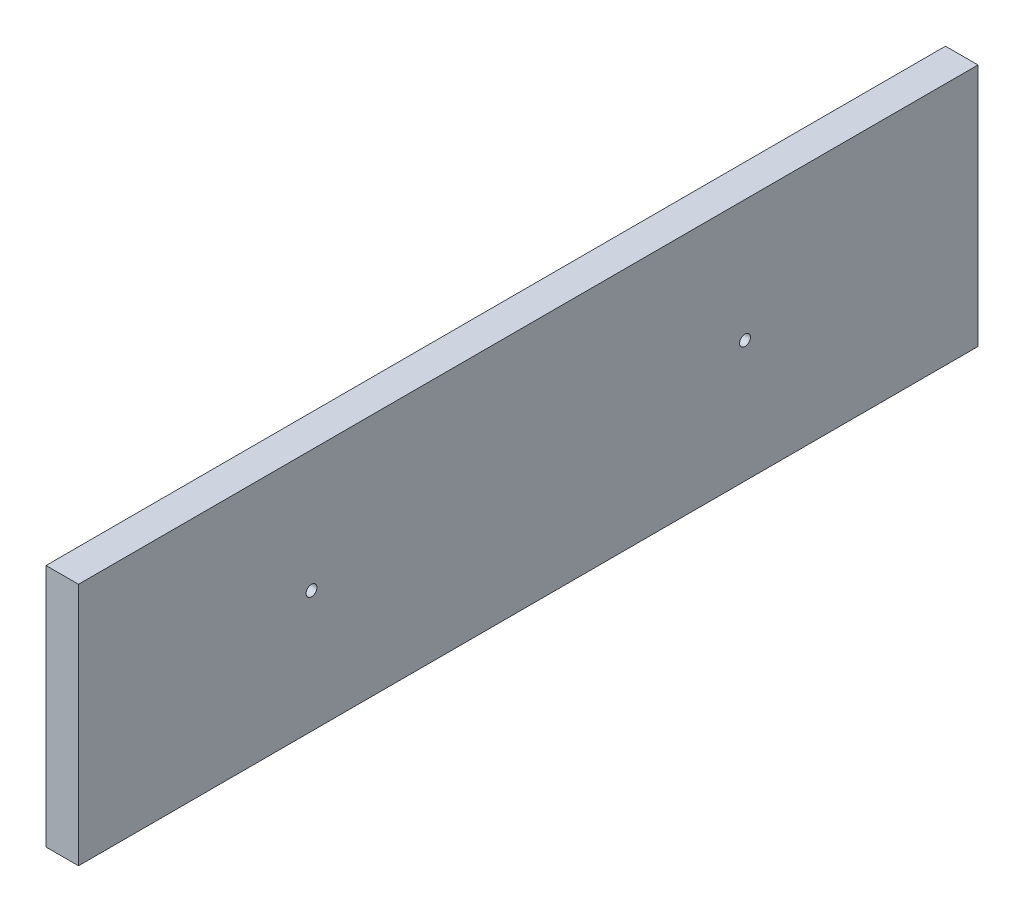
from build123d import *

# Parameters (mm, degrees)
SKETCH2_W           = 38.1
SKETCH2_H           = 285.75
BOSS_EXTRUDE2_DEPTH = 1054.1
SKETCH3_R           = 6.35
CUT_EXTRUDE1_DEPTH  = 1093.808987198


with BuildPart() as part:
    # Sketch2 → Boss-Extrude2 (new body)
    with BuildSketch(Plane.XY):
        with Locations((19.05, 142.875)):
            Rectangle(SKETCH2_W, SKETCH2_H)
    extrude(amount=BOSS_EXTRUDE2_DEPTH)

    # Sketch3 → Cut-Extrude1 (cut, through all)
    with BuildSketch(Plane(origin=(38.1, 0, 0), x_dir=(0, 0, -1), z_dir=(1, 0, 0))):
        with Locations((-781.05, 142.875)):
            Circle(SKETCH3_R)
        with Locations((-273.05, 142.875)):
            Circle(SKETCH3_R)
    extrude(amount=-CUT_EXTRUDE1_DEPTH, mode=Mode.SUBTRACT)


solid = part.part
